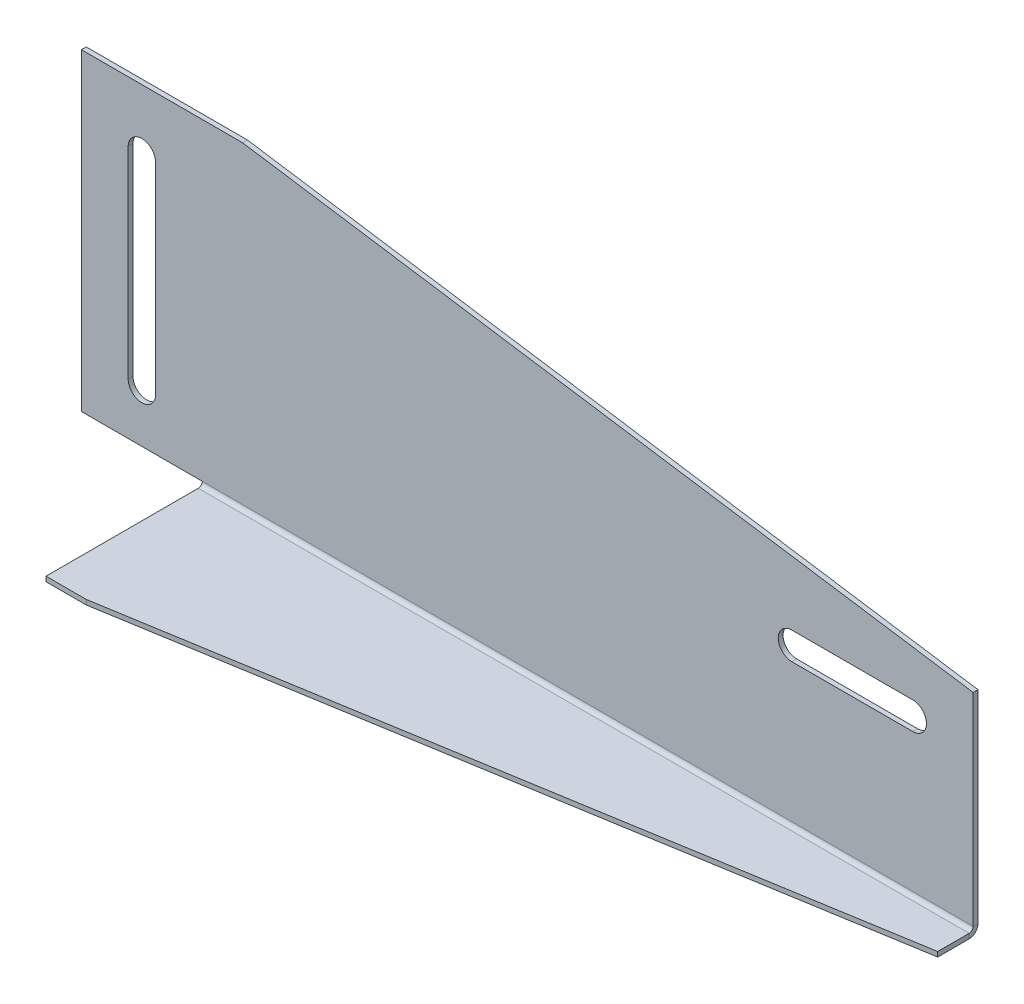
ISO-10303-21;
HEADER;
FILE_DESCRIPTION(('STEP AP214'),'2;1');
FILE_NAME('part.step','',(''),(''),'','','');
FILE_SCHEMA(('AUTOMOTIVE_DESIGN { 1 0 10303 214 1 1 1 1 }'));
ENDSEC;
DATA;
#1=APPLICATION_CONTEXT('core data for automotive mechanical design processes');
#2=APPLICATION_PROTOCOL_DEFINITION('international standard','automotive_design',2000,#1);
#3=PRODUCT_CONTEXT('',#1,'mechanical');
#4=PRODUCT('Part','Part','',(#3));
#5=PRODUCT_RELATED_PRODUCT_CATEGORY('part','',(#4));
#6=PRODUCT_DEFINITION_FORMATION('','',#4);
#7=PRODUCT_DEFINITION_CONTEXT('part definition',#1,'design');
#8=PRODUCT_DEFINITION('design','',#6,#7);
#9=PRODUCT_DEFINITION_SHAPE('','',#8);
#10=(LENGTH_UNIT() NAMED_UNIT(*) SI_UNIT(.MILLI.,.METRE.));
#11=(NAMED_UNIT(*) PLANE_ANGLE_UNIT() SI_UNIT($,.RADIAN.));
#12=(NAMED_UNIT(*) SI_UNIT($,.STERADIAN.) SOLID_ANGLE_UNIT());
#13=UNCERTAINTY_MEASURE_WITH_UNIT(LENGTH_MEASURE(1.E-05),#10,'distance_accuracy_value','');
#14=(GEOMETRIC_REPRESENTATION_CONTEXT(3) GLOBAL_UNCERTAINTY_ASSIGNED_CONTEXT((#13)) GLOBAL_UNIT_ASSIGNED_CONTEXT((#10,
#11,#12)) REPRESENTATION_CONTEXT('',''));
#15=CARTESIAN_POINT('',(0.,0.,0.));
#16=DIRECTION('',(0.,0.,1.));
#17=DIRECTION('',(1.,0.,0.));
#18=AXIS2_PLACEMENT_3D('',#15,#16,#17);
#19=CARTESIAN_POINT('',(225.,-38.8,0.));
#20=DIRECTION('',(0.,-1.,0.));
#21=DIRECTION('',(0.,0.,-1.));
#22=AXIS2_PLACEMENT_3D('',#19,#20,#21);
#23=PLANE('',#22);
#24=DIRECTION('',(0.,0.,-1.));
#25=VECTOR('',#24,1.);
#26=CARTESIAN_POINT('',(30.,-38.8,0.));
#27=LINE('',#26,#25);
#28=CARTESIAN_POINT('',(30.,-38.8,40.));
#29=VERTEX_POINT('',#28);
#30=CARTESIAN_POINT('',(30.,-38.8,2.19999999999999));
#31=VERTEX_POINT('',#30);
#32=EDGE_CURVE('E242',#29,#31,#27,.T.);
#33=ORIENTED_EDGE('',*,*,#32,.F.);
#34=DIRECTION('',(-1.,0.,0.));
#35=VECTOR('',#34,1.);
#36=CARTESIAN_POINT('',(225.,-38.8,40.));
#37=LINE('',#36,#35);
#38=CARTESIAN_POINT('',(40.,-38.8,40.));
#39=VERTEX_POINT('',#38);
#40=EDGE_CURVE('E52',#39,#29,#37,.T.);
#41=ORIENTED_EDGE('',*,*,#40,.F.);
#42=DIRECTION('',(-0.986598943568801,0.,0.163164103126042));
#43=VECTOR('',#42,1.);
#44=CARTESIAN_POINT('',(40.,-38.8,40.));
#45=LINE('',#44,#43);
#46=CARTESIAN_POINT('',(221.4,-38.8,9.99999999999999));
#47=VERTEX_POINT('',#46);
#48=EDGE_CURVE('E240',#47,#39,#45,.T.);
#49=ORIENTED_EDGE('',*,*,#48,.F.);
#50=DIRECTION('',(0.,0.,-1.));
#51=VECTOR('',#50,1.);
#52=CARTESIAN_POINT('',(221.4,-38.8,0.));
#53=LINE('',#52,#51);
#54=CARTESIAN_POINT('',(221.4,-38.8,2.19999999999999));
#55=VERTEX_POINT('',#54);
#56=EDGE_CURVE('E284',#47,#55,#53,.T.);
#57=ORIENTED_EDGE('',*,*,#56,.T.);
#58=DIRECTION('',(-1.,0.,0.));
#59=VECTOR('',#58,1.);
#60=CARTESIAN_POINT('',(225.,-38.8,2.19999999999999));
#61=LINE('',#60,#59);
#62=EDGE_CURVE('E212',#55,#31,#61,.T.);
#63=ORIENTED_EDGE('',*,*,#62,.T.);
#64=EDGE_LOOP('',(#33,#41,#49,#57,#63));
#65=FACE_BOUND('',#64,.T.);
#66=ADVANCED_FACE('F44',(#65),#23,.F.);
#67=CARTESIAN_POINT('',(225.,-40.,40.));
#68=DIRECTION('',(0.,0.,1.));
#69=DIRECTION('',(1.,0.,0.));
#70=AXIS2_PLACEMENT_3D('',#67,#68,#69);
#71=PLANE('',#70);
#72=ORIENTED_EDGE('',*,*,#40,.T.);
#73=DIRECTION('',(0.,-1.,0.));
#74=VECTOR('',#73,1.);
#75=CARTESIAN_POINT('',(30.,-40.,40.));
#76=LINE('',#75,#74);
#77=CARTESIAN_POINT('',(30.,-40.,40.));
#78=VERTEX_POINT('',#77);
#79=EDGE_CURVE('E235',#78,#29,#76,.F.);
#80=ORIENTED_EDGE('',*,*,#79,.F.);
#81=DIRECTION('',(-1.,0.,0.));
#82=VECTOR('',#81,1.);
#83=CARTESIAN_POINT('',(225.,-40.,40.));
#84=LINE('',#83,#82);
#85=CARTESIAN_POINT('',(40.,-40.,40.));
#86=VERTEX_POINT('',#85);
#87=EDGE_CURVE('E226',#86,#78,#84,.T.);
#88=ORIENTED_EDGE('',*,*,#87,.F.);
#89=DIRECTION('',(0.,1.,0.));
#90=VECTOR('',#89,1.);
#91=CARTESIAN_POINT('',(40.,-38.8,40.));
#92=LINE('',#91,#90);
#93=EDGE_CURVE('E236',#39,#86,#92,.F.);
#94=ORIENTED_EDGE('',*,*,#93,.F.);
#95=EDGE_LOOP('',(#72,#80,#88,#94));
#96=FACE_BOUND('',#95,.T.);
#97=ADVANCED_FACE('F233',(#96),#71,.T.);
#98=CARTESIAN_POINT('',(225.,-40.,0.));
#99=DIRECTION('',(0.,-1.,0.));
#100=DIRECTION('',(0.,0.,-1.));
#101=AXIS2_PLACEMENT_3D('',#98,#99,#100);
#102=PLANE('',#101);
#103=ORIENTED_EDGE('',*,*,#87,.T.);
#104=DIRECTION('',(0.,0.,-1.));
#105=VECTOR('',#104,1.);
#106=CARTESIAN_POINT('',(30.,-40.,1.19999999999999));
#107=LINE('',#106,#105);
#108=CARTESIAN_POINT('',(30.,-40.,2.19999999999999));
#109=VERTEX_POINT('',#108);
#110=EDGE_CURVE('E248',#78,#109,#107,.T.);
#111=ORIENTED_EDGE('',*,*,#110,.T.);
#112=DIRECTION('',(-1.,0.,0.));
#113=VECTOR('',#112,1.);
#114=CARTESIAN_POINT('',(225.,-40.,2.19999999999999));
#115=LINE('',#114,#113);
#116=CARTESIAN_POINT('',(221.4,-40.,2.19999999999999));
#117=VERTEX_POINT('',#116);
#118=EDGE_CURVE('E223',#117,#109,#115,.T.);
#119=ORIENTED_EDGE('',*,*,#118,.F.);
#120=DIRECTION('',(0.,0.,-1.));
#121=VECTOR('',#120,1.);
#122=CARTESIAN_POINT('',(221.4,-40.,40.001));
#123=LINE('',#122,#121);
#124=CARTESIAN_POINT('',(221.4,-40.,9.99999999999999));
#125=VERTEX_POINT('',#124);
#126=EDGE_CURVE('E281',#125,#117,#123,.T.);
#127=ORIENTED_EDGE('',*,*,#126,.F.);
#128=DIRECTION('',(-0.986598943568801,0.,0.163164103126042));
#129=VECTOR('',#128,1.);
#130=CARTESIAN_POINT('',(40.,-40.,40.));
#131=LINE('',#130,#129);
#132=EDGE_CURVE('E59',#125,#86,#131,.T.);
#133=ORIENTED_EDGE('',*,*,#132,.T.);
#134=EDGE_LOOP('',(#103,#111,#119,#127,#133));
#135=FACE_BOUND('',#134,.T.);
#136=ADVANCED_FACE('F380',(#135),#102,.T.);
#137=CARTESIAN_POINT('',(225.,-37.8,2.19999999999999));
#138=DIRECTION('',(-1.,0.,0.));
#139=DIRECTION('',(0.,0.,1.));
#140=AXIS2_PLACEMENT_3D('',#137,#138,#139);
#141=CYLINDRICAL_SURFACE('',#140,2.2);
#142=ORIENTED_EDGE('',*,*,#118,.T.);
#143=CARTESIAN_POINT('',(30.,-37.8,2.19999999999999));
#144=DIRECTION('',(-1.,0.,0.));
#145=DIRECTION('',(0.,0.,1.));
#146=AXIS2_PLACEMENT_3D('',#143,#144,#145);
#147=CIRCLE('',#146,2.2);
#148=CARTESIAN_POINT('',(30.,-37.8,0.));
#149=VERTEX_POINT('',#148);
#150=EDGE_CURVE('E198',#109,#149,#147,.F.);
#151=ORIENTED_EDGE('',*,*,#150,.T.);
#152=DIRECTION('',(-1.,0.,0.));
#153=VECTOR('',#152,1.);
#154=CARTESIAN_POINT('',(225.,-37.8,0.));
#155=LINE('',#154,#153);
#156=CARTESIAN_POINT('',(221.4,-37.8,0.));
#157=VERTEX_POINT('',#156);
#158=EDGE_CURVE('E196',#157,#149,#155,.T.);
#159=ORIENTED_EDGE('',*,*,#158,.F.);
#160=CARTESIAN_POINT('',(221.4,-37.8,2.19999999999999));
#161=DIRECTION('',(1.,0.,0.));
#162=DIRECTION('',(0.,0.,-1.));
#163=AXIS2_PLACEMENT_3D('',#160,#161,#162);
#164=CIRCLE('',#163,2.2);
#165=EDGE_CURVE('E261',#117,#157,#164,.T.);
#166=ORIENTED_EDGE('',*,*,#165,.F.);
#167=EDGE_LOOP('',(#142,#151,#159,#166));
#168=FACE_BOUND('',#167,.T.);
#169=ADVANCED_FACE('F385',(#168),#141,.T.);
#170=CARTESIAN_POINT('',(225.,-37.8,2.19999999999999));
#171=DIRECTION('',(-1.,0.,0.));
#172=DIRECTION('',(0.,0.,1.));
#173=AXIS2_PLACEMENT_3D('',#170,#171,#172);
#174=CYLINDRICAL_SURFACE('',#173,1.);
#175=CARTESIAN_POINT('',(30.,-37.8,2.19999999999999));
#176=DIRECTION('',(1.,0.,0.));
#177=DIRECTION('',(0.,0.,-1.));
#178=AXIS2_PLACEMENT_3D('',#175,#176,#177);
#179=CIRCLE('',#178,1.);
#180=CARTESIAN_POINT('',(30.,-37.8,1.19999999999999));
#181=VERTEX_POINT('',#180);
#182=EDGE_CURVE('E476',#31,#181,#179,.T.);
#183=ORIENTED_EDGE('',*,*,#182,.F.);
#184=ORIENTED_EDGE('',*,*,#62,.F.);
#185=CARTESIAN_POINT('',(221.4,-37.8,2.19999999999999));
#186=DIRECTION('',(-1.,0.,0.));
#187=DIRECTION('',(0.,0.,1.));
#188=AXIS2_PLACEMENT_3D('',#185,#186,#187);
#189=CIRCLE('',#188,1.);
#190=CARTESIAN_POINT('',(221.4,-37.8,1.19999999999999));
#191=VERTEX_POINT('',#190);
#192=EDGE_CURVE('E263',#55,#191,#189,.F.);
#193=ORIENTED_EDGE('',*,*,#192,.T.);
#194=DIRECTION('',(-1.,0.,0.));
#195=VECTOR('',#194,1.);
#196=CARTESIAN_POINT('',(225.,-37.8,1.19999999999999));
#197=LINE('',#196,#195);
#198=EDGE_CURVE('E215',#191,#181,#197,.T.);
#199=ORIENTED_EDGE('',*,*,#198,.T.);
#200=EDGE_LOOP('',(#183,#184,#193,#199));
#201=FACE_BOUND('',#200,.T.);
#202=ADVANCED_FACE('F389',(#201),#174,.F.);
#203=CARTESIAN_POINT('',(221.4,-40.,40.001));
#204=DIRECTION('',(-1.,0.,0.));
#205=DIRECTION('',(0.,0.,-1.));
#206=AXIS2_PLACEMENT_3D('',#203,#204,#205);
#207=PLANE('',#206);
#208=ORIENTED_EDGE('',*,*,#56,.F.);
#209=DIRECTION('',(0.,1.,0.));
#210=VECTOR('',#209,1.);
#211=CARTESIAN_POINT('',(221.4,-38.8,9.99999999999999));
#212=LINE('',#211,#210);
#213=EDGE_CURVE('E259',#47,#125,#212,.F.);
#214=ORIENTED_EDGE('',*,*,#213,.T.);
#215=ORIENTED_EDGE('',*,*,#126,.T.);
#216=DIRECTION('',(0.,-1.,0.));
#217=VECTOR('',#216,1.);
#218=CARTESIAN_POINT('',(221.4,-40.,2.19999999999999));
#219=LINE('',#218,#217);
#220=EDGE_CURVE('E286',#117,#55,#219,.F.);
#221=ORIENTED_EDGE('',*,*,#220,.T.);
#222=EDGE_LOOP('',(#208,#214,#215,#221));
#223=FACE_BOUND('',#222,.T.);
#224=ADVANCED_FACE('F393',(#223),#207,.F.);
#225=CARTESIAN_POINT('',(225.,40.,0.));
#226=DIRECTION('',(0.,0.,-1.));
#227=DIRECTION('',(-1.,0.,0.));
#228=AXIS2_PLACEMENT_3D('',#225,#226,#227);
#229=PLANE('',#228);
#230=CARTESIAN_POINT('',(176.4,0.,0.));
#231=DIRECTION('',(0.,0.,-1.));
#232=DIRECTION('',(-1.,0.,0.));
#233=AXIS2_PLACEMENT_3D('',#230,#231,#232);
#234=CIRCLE('',#233,3.4);
#235=CARTESIAN_POINT('',(176.4,-3.4,0.));
#236=VERTEX_POINT('',#235);
#237=CARTESIAN_POINT('',(176.4,3.4,0.));
#238=VERTEX_POINT('',#237);
#239=EDGE_CURVE('E293',#236,#238,#234,.T.);
#240=ORIENTED_EDGE('',*,*,#239,.F.);
#241=DIRECTION('',(-1.,0.,0.));
#242=VECTOR('',#241,1.);
#243=CARTESIAN_POINT('',(225.,-3.4,0.));
#244=LINE('',#243,#242);
#245=CARTESIAN_POINT('',(206.4,-3.4,0.));
#246=VERTEX_POINT('',#245);
#247=EDGE_CURVE('E298',#246,#236,#244,.T.);
#248=ORIENTED_EDGE('',*,*,#247,.F.);
#249=CARTESIAN_POINT('',(206.4,0.,0.));
#250=DIRECTION('',(0.,0.,-1.));
#251=DIRECTION('',(-1.,0.,0.));
#252=AXIS2_PLACEMENT_3D('',#249,#250,#251);
#253=CIRCLE('',#252,3.4);
#254=CARTESIAN_POINT('',(206.4,3.4,0.));
#255=VERTEX_POINT('',#254);
#256=EDGE_CURVE('E295',#255,#246,#253,.T.);
#257=ORIENTED_EDGE('',*,*,#256,.F.);
#258=DIRECTION('',(-1.,0.,0.));
#259=VECTOR('',#258,1.);
#260=CARTESIAN_POINT('',(225.,3.4,0.));
#261=LINE('',#260,#259);
#262=EDGE_CURVE('E291',#238,#255,#261,.F.);
#263=ORIENTED_EDGE('',*,*,#262,.F.);
#264=EDGE_LOOP('',(#240,#248,#257,#263));
#265=FACE_BOUND('',#264,.T.);
#266=CARTESIAN_POINT('',(15.,25.,0.));
#267=DIRECTION('',(0.,0.,-1.));
#268=DIRECTION('',(-1.,0.,0.));
#269=AXIS2_PLACEMENT_3D('',#266,#267,#268);
#270=CIRCLE('',#269,3.40000000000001);
#271=CARTESIAN_POINT('',(11.6,25.,0.));
#272=VERTEX_POINT('',#271);
#273=CARTESIAN_POINT('',(18.4,25.,0.));
#274=VERTEX_POINT('',#273);
#275=EDGE_CURVE('E325',#272,#274,#270,.T.);
#276=ORIENTED_EDGE('',*,*,#275,.F.);
#277=DIRECTION('',(0.,1.,0.));
#278=VECTOR('',#277,1.);
#279=CARTESIAN_POINT('',(11.6,40.,0.));
#280=LINE('',#279,#278);
#281=CARTESIAN_POINT('',(11.6,-25.,0.));
#282=VERTEX_POINT('',#281);
#283=EDGE_CURVE('E329',#282,#272,#280,.T.);
#284=ORIENTED_EDGE('',*,*,#283,.F.);
#285=CARTESIAN_POINT('',(15.,-25.,0.));
#286=DIRECTION('',(0.,0.,-1.));
#287=DIRECTION('',(-1.,0.,0.));
#288=AXIS2_PLACEMENT_3D('',#285,#286,#287);
#289=CIRCLE('',#288,3.40000000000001);
#290=CARTESIAN_POINT('',(18.4,-25.,0.));
#291=VERTEX_POINT('',#290);
#292=EDGE_CURVE('E327',#291,#282,#289,.T.);
#293=ORIENTED_EDGE('',*,*,#292,.F.);
#294=DIRECTION('',(0.,1.,0.));
#295=VECTOR('',#294,1.);
#296=CARTESIAN_POINT('',(18.4,40.,0.));
#297=LINE('',#296,#295);
#298=EDGE_CURVE('E323',#274,#291,#297,.F.);
#299=ORIENTED_EDGE('',*,*,#298,.F.);
#300=EDGE_LOOP('',(#276,#284,#293,#299));
#301=FACE_BOUND('',#300,.T.);
#302=DIRECTION('',(-0.988703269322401,0.149886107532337,0.));
#303=VECTOR('',#302,1.);
#304=CARTESIAN_POINT('',(40.,40.,0.));
#305=LINE('',#304,#303);
#306=CARTESIAN_POINT('',(221.4,12.5,0.));
#307=VERTEX_POINT('',#306);
#308=CARTESIAN_POINT('',(40.,40.,0.));
#309=VERTEX_POINT('',#308);
#310=EDGE_CURVE('E271',#307,#309,#305,.T.);
#311=ORIENTED_EDGE('',*,*,#310,.F.);
#312=DIRECTION('',(0.,1.,0.));
#313=VECTOR('',#312,1.);
#314=CARTESIAN_POINT('',(221.4,40.,0.));
#315=LINE('',#314,#313);
#316=EDGE_CURVE('E268',#157,#307,#315,.T.);
#317=ORIENTED_EDGE('',*,*,#316,.F.);
#318=ORIENTED_EDGE('',*,*,#158,.T.);
#319=DIRECTION('',(-1.,0.,0.));
#320=VECTOR('',#319,1.);
#321=CARTESIAN_POINT('',(225.,-37.8,0.));
#322=LINE('',#321,#320);
#323=CARTESIAN_POINT('',(0.,-37.8,0.));
#324=VERTEX_POINT('',#323);
#325=EDGE_CURVE('E178',#324,#149,#322,.F.);
#326=ORIENTED_EDGE('',*,*,#325,.F.);
#327=DIRECTION('',(0.,-1.,0.));
#328=VECTOR('',#327,1.);
#329=CARTESIAN_POINT('',(0.,40.,0.));
#330=LINE('',#329,#328);
#331=CARTESIAN_POINT('',(0.,40.,0.));
#332=VERTEX_POINT('',#331);
#333=EDGE_CURVE('E192',#332,#324,#330,.T.);
#334=ORIENTED_EDGE('',*,*,#333,.F.);
#335=DIRECTION('',(-1.,0.,0.));
#336=VECTOR('',#335,1.);
#337=CARTESIAN_POINT('',(225.,40.,0.));
#338=LINE('',#337,#336);
#339=EDGE_CURVE('E220',#309,#332,#338,.T.);
#340=ORIENTED_EDGE('',*,*,#339,.F.);
#341=EDGE_LOOP('',(#311,#317,#318,#326,#334,#340));
#342=FACE_BOUND('',#341,.T.);
#343=ADVANCED_FACE('F190',(#265,#301,#342),#229,.T.);
#344=CARTESIAN_POINT('',(225.,40.,1.19999999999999));
#345=DIRECTION('',(0.,0.,-1.));
#346=DIRECTION('',(-1.,0.,0.));
#347=AXIS2_PLACEMENT_3D('',#344,#345,#346);
#348=PLANE('',#347);
#349=DIRECTION('',(-1.,0.,0.));
#350=VECTOR('',#349,1.);
#351=CARTESIAN_POINT('',(176.4,-3.4,1.19999999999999));
#352=LINE('',#351,#350);
#353=CARTESIAN_POINT('',(206.4,-3.4,1.19999999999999));
#354=VERTEX_POINT('',#353);
#355=CARTESIAN_POINT('',(176.4,-3.4,1.19999999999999));
#356=VERTEX_POINT('',#355);
#357=EDGE_CURVE('E307',#354,#356,#352,.T.);
#358=ORIENTED_EDGE('',*,*,#357,.T.);
#359=CARTESIAN_POINT('',(176.4,0.,1.19999999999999));
#360=DIRECTION('',(0.,0.,-1.));
#361=DIRECTION('',(-1.,0.,0.));
#362=AXIS2_PLACEMENT_3D('',#359,#360,#361);
#363=CIRCLE('',#362,3.4);
#364=CARTESIAN_POINT('',(176.4,3.4,1.19999999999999));
#365=VERTEX_POINT('',#364);
#366=EDGE_CURVE('E304',#356,#365,#363,.T.);
#367=ORIENTED_EDGE('',*,*,#366,.T.);
#368=DIRECTION('',(1.,0.,0.));
#369=VECTOR('',#368,1.);
#370=CARTESIAN_POINT('',(176.4,3.4,1.19999999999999));
#371=LINE('',#370,#369);
#372=CARTESIAN_POINT('',(206.4,3.4,1.19999999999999));
#373=VERTEX_POINT('',#372);
#374=EDGE_CURVE('E290',#365,#373,#371,.T.);
#375=ORIENTED_EDGE('',*,*,#374,.T.);
#376=CARTESIAN_POINT('',(206.4,0.,1.19999999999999));
#377=DIRECTION('',(0.,0.,-1.));
#378=DIRECTION('',(-1.,0.,0.));
#379=AXIS2_PLACEMENT_3D('',#376,#377,#378);
#380=CIRCLE('',#379,3.4);
#381=EDGE_CURVE('E294',#373,#354,#380,.T.);
#382=ORIENTED_EDGE('',*,*,#381,.T.);
#383=EDGE_LOOP('',(#358,#367,#375,#382));
#384=FACE_BOUND('',#383,.T.);
#385=DIRECTION('',(0.,1.,0.));
#386=VECTOR('',#385,1.);
#387=CARTESIAN_POINT('',(11.6,25.,1.19999999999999));
#388=LINE('',#387,#386);
#389=CARTESIAN_POINT('',(11.6,-25.,1.19999999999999));
#390=VERTEX_POINT('',#389);
#391=CARTESIAN_POINT('',(11.6,25.,1.19999999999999));
#392=VERTEX_POINT('',#391);
#393=EDGE_CURVE('E338',#390,#392,#388,.T.);
#394=ORIENTED_EDGE('',*,*,#393,.T.);
#395=CARTESIAN_POINT('',(15.,25.,1.19999999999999));
#396=DIRECTION('',(0.,0.,-1.));
#397=DIRECTION('',(-1.,0.,0.));
#398=AXIS2_PLACEMENT_3D('',#395,#396,#397);
#399=CIRCLE('',#398,3.40000000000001);
#400=CARTESIAN_POINT('',(18.4,25.,1.19999999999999));
#401=VERTEX_POINT('',#400);
#402=EDGE_CURVE('E335',#392,#401,#399,.T.);
#403=ORIENTED_EDGE('',*,*,#402,.T.);
#404=DIRECTION('',(0.,-1.,0.));
#405=VECTOR('',#404,1.);
#406=CARTESIAN_POINT('',(18.4,25.,1.19999999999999));
#407=LINE('',#406,#405);
#408=CARTESIAN_POINT('',(18.4,-25.,1.19999999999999));
#409=VERTEX_POINT('',#408);
#410=EDGE_CURVE('E320',#401,#409,#407,.T.);
#411=ORIENTED_EDGE('',*,*,#410,.T.);
#412=CARTESIAN_POINT('',(15.,-25.,1.19999999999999));
#413=DIRECTION('',(0.,0.,-1.));
#414=DIRECTION('',(-1.,0.,0.));
#415=AXIS2_PLACEMENT_3D('',#412,#413,#414);
#416=CIRCLE('',#415,3.40000000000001);
#417=EDGE_CURVE('E326',#409,#390,#416,.T.);
#418=ORIENTED_EDGE('',*,*,#417,.T.);
#419=EDGE_LOOP('',(#394,#403,#411,#418));
#420=FACE_BOUND('',#419,.T.);
#421=DIRECTION('',(0.,1.,0.));
#422=VECTOR('',#421,1.);
#423=CARTESIAN_POINT('',(221.4,12.5,1.19999999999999));
#424=LINE('',#423,#422);
#425=CARTESIAN_POINT('',(221.4,12.5,1.19999999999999));
#426=VERTEX_POINT('',#425);
#427=EDGE_CURVE('E67',#191,#426,#424,.T.);
#428=ORIENTED_EDGE('',*,*,#427,.T.);
#429=DIRECTION('',(-0.988703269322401,0.149886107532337,0.));
#430=VECTOR('',#429,1.);
#431=CARTESIAN_POINT('',(40.,40.,1.19999999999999));
#432=LINE('',#431,#430);
#433=CARTESIAN_POINT('',(40.,40.,1.19999999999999));
#434=VERTEX_POINT('',#433);
#435=EDGE_CURVE('E266',#426,#434,#432,.T.);
#436=ORIENTED_EDGE('',*,*,#435,.T.);
#437=DIRECTION('',(-1.,0.,0.));
#438=VECTOR('',#437,1.);
#439=CARTESIAN_POINT('',(225.,40.,1.19999999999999));
#440=LINE('',#439,#438);
#441=CARTESIAN_POINT('',(0.,40.,1.19999999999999));
#442=VERTEX_POINT('',#441);
#443=EDGE_CURVE('E218',#434,#442,#440,.T.);
#444=ORIENTED_EDGE('',*,*,#443,.T.);
#445=DIRECTION('',(0.,1.,0.));
#446=VECTOR('',#445,1.);
#447=CARTESIAN_POINT('',(0.,40.,1.19999999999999));
#448=LINE('',#447,#446);
#449=CARTESIAN_POINT('',(0.,-37.8,1.19999999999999));
#450=VERTEX_POINT('',#449);
#451=EDGE_CURVE('E204',#442,#450,#448,.F.);
#452=ORIENTED_EDGE('',*,*,#451,.T.);
#453=DIRECTION('',(-1.,0.,0.));
#454=VECTOR('',#453,1.);
#455=CARTESIAN_POINT('',(225.,-37.8,1.19999999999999));
#456=LINE('',#455,#454);
#457=EDGE_CURVE('E181',#450,#181,#456,.F.);
#458=ORIENTED_EDGE('',*,*,#457,.T.);
#459=ORIENTED_EDGE('',*,*,#198,.F.);
#460=EDGE_LOOP('',(#428,#436,#444,#452,#458,#459));
#461=FACE_BOUND('',#460,.T.);
#462=ADVANCED_FACE('F365',(#384,#420,#461),#348,.F.);
#463=CARTESIAN_POINT('',(225.,40.,1.19999999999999));
#464=DIRECTION('',(0.,1.,0.));
#465=DIRECTION('',(0.,0.,1.));
#466=AXIS2_PLACEMENT_3D('',#463,#464,#465);
#467=PLANE('',#466);
#468=ORIENTED_EDGE('',*,*,#443,.F.);
#469=DIRECTION('',(0.,0.,1.));
#470=VECTOR('',#469,1.);
#471=CARTESIAN_POINT('',(40.,40.,1.19999999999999));
#472=LINE('',#471,#470);
#473=EDGE_CURVE('E270',#434,#309,#472,.F.);
#474=ORIENTED_EDGE('',*,*,#473,.T.);
#475=ORIENTED_EDGE('',*,*,#339,.T.);
#476=DIRECTION('',(0.,0.,-1.));
#477=VECTOR('',#476,1.);
#478=CARTESIAN_POINT('',(0.,40.,1.19999999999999));
#479=LINE('',#478,#477);
#480=EDGE_CURVE('E201',#442,#332,#479,.T.);
#481=ORIENTED_EDGE('',*,*,#480,.F.);
#482=EDGE_LOOP('',(#468,#474,#475,#481));
#483=FACE_BOUND('',#482,.T.);
#484=ADVANCED_FACE('F395',(#483),#467,.T.);
#485=CARTESIAN_POINT('',(0.,-38.8,2.19999999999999));
#486=DIRECTION('',(-1.,0.,0.));
#487=DIRECTION('',(0.,0.,1.));
#488=AXIS2_PLACEMENT_3D('',#485,#486,#487);
#489=PLANE('',#488);
#490=ORIENTED_EDGE('',*,*,#333,.T.);
#491=DIRECTION('',(0.,0.,1.));
#492=VECTOR('',#491,1.);
#493=CARTESIAN_POINT('',(0.,-37.8,0.));
#494=LINE('',#493,#492);
#495=EDGE_CURVE('E13',#324,#450,#494,.T.);
#496=ORIENTED_EDGE('',*,*,#495,.T.);
#497=ORIENTED_EDGE('',*,*,#451,.F.);
#498=ORIENTED_EDGE('',*,*,#480,.T.);
#499=EDGE_LOOP('',(#490,#496,#497,#498));
#500=FACE_BOUND('',#499,.T.);
#501=ADVANCED_FACE('F46',(#500),#489,.T.);
#502=CARTESIAN_POINT('',(11.6,25.,1.19999999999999));
#503=DIRECTION('',(-1.,0.,0.));
#504=DIRECTION('',(0.,1.,0.));
#505=AXIS2_PLACEMENT_3D('',#502,#503,#504);
#506=PLANE('',#505);
#507=DIRECTION('',(0.,0.,1.));
#508=VECTOR('',#507,1.);
#509=CARTESIAN_POINT('',(11.6,25.,1.19999999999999));
#510=LINE('',#509,#508);
#511=EDGE_CURVE('E202',#392,#272,#510,.F.);
#512=ORIENTED_EDGE('',*,*,#511,.F.);
#513=ORIENTED_EDGE('',*,*,#393,.F.);
#514=DIRECTION('',(0.,0.,1.));
#515=VECTOR('',#514,1.);
#516=CARTESIAN_POINT('',(11.6,-25.,1.19999999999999));
#517=LINE('',#516,#515);
#518=EDGE_CURVE('E206',#390,#282,#517,.F.);
#519=ORIENTED_EDGE('',*,*,#518,.T.);
#520=ORIENTED_EDGE('',*,*,#283,.T.);
#521=EDGE_LOOP('',(#512,#513,#519,#520));
#522=FACE_BOUND('',#521,.T.);
#523=ADVANCED_FACE('F351',(#522),#506,.F.);
#524=CARTESIAN_POINT('',(15.,-25.,1.19999999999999));
#525=DIRECTION('',(0.,0.,-1.));
#526=DIRECTION('',(-1.,0.,0.));
#527=AXIS2_PLACEMENT_3D('',#524,#525,#526);
#528=CYLINDRICAL_SURFACE('',#527,3.40000000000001);
#529=ORIENTED_EDGE('',*,*,#518,.F.);
#530=ORIENTED_EDGE('',*,*,#417,.F.);
#531=DIRECTION('',(0.,0.,1.));
#532=VECTOR('',#531,1.);
#533=CARTESIAN_POINT('',(18.4,-25.,1.19999999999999));
#534=LINE('',#533,#532);
#535=EDGE_CURVE('E343',#409,#291,#534,.F.);
#536=ORIENTED_EDGE('',*,*,#535,.T.);
#537=ORIENTED_EDGE('',*,*,#292,.T.);
#538=EDGE_LOOP('',(#529,#530,#536,#537));
#539=FACE_BOUND('',#538,.T.);
#540=ADVANCED_FACE('F367',(#539),#528,.F.);
#541=CARTESIAN_POINT('',(18.4,25.,1.19999999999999));
#542=DIRECTION('',(1.,0.,0.));
#543=DIRECTION('',(0.,-1.,0.));
#544=AXIS2_PLACEMENT_3D('',#541,#542,#543);
#545=PLANE('',#544);
#546=ORIENTED_EDGE('',*,*,#535,.F.);
#547=ORIENTED_EDGE('',*,*,#410,.F.);
#548=DIRECTION('',(0.,0.,1.));
#549=VECTOR('',#548,1.);
#550=CARTESIAN_POINT('',(18.4,25.,1.19999999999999));
#551=LINE('',#550,#549);
#552=EDGE_CURVE('E209',#401,#274,#551,.F.);
#553=ORIENTED_EDGE('',*,*,#552,.T.);
#554=ORIENTED_EDGE('',*,*,#298,.T.);
#555=EDGE_LOOP('',(#546,#547,#553,#554));
#556=FACE_BOUND('',#555,.T.);
#557=ADVANCED_FACE('F363',(#556),#545,.F.);
#558=CARTESIAN_POINT('',(15.,25.,1.19999999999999));
#559=DIRECTION('',(0.,0.,-1.));
#560=DIRECTION('',(-1.,0.,0.));
#561=AXIS2_PLACEMENT_3D('',#558,#559,#560);
#562=CYLINDRICAL_SURFACE('',#561,3.40000000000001);
#563=ORIENTED_EDGE('',*,*,#402,.F.);
#564=ORIENTED_EDGE('',*,*,#511,.T.);
#565=ORIENTED_EDGE('',*,*,#275,.T.);
#566=ORIENTED_EDGE('',*,*,#552,.F.);
#567=EDGE_LOOP('',(#563,#564,#565,#566));
#568=FACE_BOUND('',#567,.T.);
#569=ADVANCED_FACE('F359',(#568),#562,.F.);
#570=CARTESIAN_POINT('',(176.4,-3.4,1.19999999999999));
#571=DIRECTION('',(0.,-1.,0.));
#572=DIRECTION('',(-1.,0.,0.));
#573=AXIS2_PLACEMENT_3D('',#570,#571,#572);
#574=PLANE('',#573);
#575=DIRECTION('',(0.,0.,1.));
#576=VECTOR('',#575,1.);
#577=CARTESIAN_POINT('',(176.4,-3.4,1.19999999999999));
#578=LINE('',#577,#576);
#579=EDGE_CURVE('E318',#356,#236,#578,.F.);
#580=ORIENTED_EDGE('',*,*,#579,.F.);
#581=ORIENTED_EDGE('',*,*,#357,.F.);
#582=DIRECTION('',(0.,0.,1.));
#583=VECTOR('',#582,1.);
#584=CARTESIAN_POINT('',(206.4,-3.4,1.19999999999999));
#585=LINE('',#584,#583);
#586=EDGE_CURVE('E315',#354,#246,#585,.F.);
#587=ORIENTED_EDGE('',*,*,#586,.T.);
#588=ORIENTED_EDGE('',*,*,#247,.T.);
#589=EDGE_LOOP('',(#580,#581,#587,#588));
#590=FACE_BOUND('',#589,.T.);
#591=ADVANCED_FACE('F406',(#590),#574,.F.);
#592=CARTESIAN_POINT('',(206.4,0.,1.19999999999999));
#593=DIRECTION('',(0.,0.,-1.));
#594=DIRECTION('',(-1.,0.,0.));
#595=AXIS2_PLACEMENT_3D('',#592,#593,#594);
#596=CYLINDRICAL_SURFACE('',#595,3.4);
#597=ORIENTED_EDGE('',*,*,#586,.F.);
#598=ORIENTED_EDGE('',*,*,#381,.F.);
#599=DIRECTION('',(0.,0.,1.));
#600=VECTOR('',#599,1.);
#601=CARTESIAN_POINT('',(206.4,3.4,1.19999999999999));
#602=LINE('',#601,#600);
#603=EDGE_CURVE('E312',#373,#255,#602,.F.);
#604=ORIENTED_EDGE('',*,*,#603,.T.);
#605=ORIENTED_EDGE('',*,*,#256,.T.);
#606=EDGE_LOOP('',(#597,#598,#604,#605));
#607=FACE_BOUND('',#606,.T.);
#608=ADVANCED_FACE('F410',(#607),#596,.F.);
#609=CARTESIAN_POINT('',(176.4,3.4,1.19999999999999));
#610=DIRECTION('',(0.,1.,0.));
#611=DIRECTION('',(1.,0.,0.));
#612=AXIS2_PLACEMENT_3D('',#609,#610,#611);
#613=PLANE('',#612);
#614=ORIENTED_EDGE('',*,*,#603,.F.);
#615=ORIENTED_EDGE('',*,*,#374,.F.);
#616=DIRECTION('',(0.,0.,1.));
#617=VECTOR('',#616,1.);
#618=CARTESIAN_POINT('',(176.4,3.4,1.19999999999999));
#619=LINE('',#618,#617);
#620=EDGE_CURVE('E297',#365,#238,#619,.F.);
#621=ORIENTED_EDGE('',*,*,#620,.T.);
#622=ORIENTED_EDGE('',*,*,#262,.T.);
#623=EDGE_LOOP('',(#614,#615,#621,#622));
#624=FACE_BOUND('',#623,.T.);
#625=ADVANCED_FACE('F416',(#624),#613,.F.);
#626=CARTESIAN_POINT('',(176.4,0.,1.19999999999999));
#627=DIRECTION('',(0.,0.,-1.));
#628=DIRECTION('',(-1.,0.,0.));
#629=AXIS2_PLACEMENT_3D('',#626,#627,#628);
#630=CYLINDRICAL_SURFACE('',#629,3.4);
#631=ORIENTED_EDGE('',*,*,#366,.F.);
#632=ORIENTED_EDGE('',*,*,#579,.T.);
#633=ORIENTED_EDGE('',*,*,#239,.T.);
#634=ORIENTED_EDGE('',*,*,#620,.F.);
#635=EDGE_LOOP('',(#631,#632,#633,#634));
#636=FACE_BOUND('',#635,.T.);
#637=ADVANCED_FACE('F422',(#636),#630,.F.);
#638=CARTESIAN_POINT('',(221.4,12.5,1.19999999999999));
#639=DIRECTION('',(-1.,0.,0.));
#640=DIRECTION('',(0.,1.,0.));
#641=AXIS2_PLACEMENT_3D('',#638,#639,#640);
#642=PLANE('',#641);
#643=DIRECTION('',(0.,0.,1.));
#644=VECTOR('',#643,1.);
#645=CARTESIAN_POINT('',(221.4,12.5,1.19999999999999));
#646=LINE('',#645,#644);
#647=EDGE_CURVE('E278',#426,#307,#646,.F.);
#648=ORIENTED_EDGE('',*,*,#647,.F.);
#649=ORIENTED_EDGE('',*,*,#427,.F.);
#650=DIRECTION('',(0.,0.,1.));
#651=VECTOR('',#650,1.);
#652=CARTESIAN_POINT('',(221.4,-37.8,1.19999999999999));
#653=LINE('',#652,#651);
#654=EDGE_CURVE('E276',#191,#157,#653,.F.);
#655=ORIENTED_EDGE('',*,*,#654,.T.);
#656=ORIENTED_EDGE('',*,*,#316,.T.);
#657=EDGE_LOOP('',(#648,#649,#655,#656));
#658=FACE_BOUND('',#657,.T.);
#659=ADVANCED_FACE('F424',(#658),#642,.F.);
#660=CARTESIAN_POINT('',(40.,40.,1.19999999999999));
#661=DIRECTION('',(-0.149886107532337,-0.988703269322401,0.));
#662=DIRECTION('',(-0.988703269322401,0.149886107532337,0.));
#663=AXIS2_PLACEMENT_3D('',#660,#661,#662);
#664=PLANE('',#663);
#665=ORIENTED_EDGE('',*,*,#435,.F.);
#666=ORIENTED_EDGE('',*,*,#647,.T.);
#667=ORIENTED_EDGE('',*,*,#310,.T.);
#668=ORIENTED_EDGE('',*,*,#473,.F.);
#669=EDGE_LOOP('',(#665,#666,#667,#668));
#670=FACE_BOUND('',#669,.T.);
#671=ADVANCED_FACE('F430',(#670),#664,.F.);
#672=CARTESIAN_POINT('',(221.4,-37.8,2.19999999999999));
#673=DIRECTION('',(-1.,0.,0.));
#674=DIRECTION('',(0.,0.,1.));
#675=AXIS2_PLACEMENT_3D('',#672,#673,#674);
#676=PLANE('',#675);
#677=ORIENTED_EDGE('',*,*,#220,.F.);
#678=ORIENTED_EDGE('',*,*,#165,.T.);
#679=ORIENTED_EDGE('',*,*,#654,.F.);
#680=ORIENTED_EDGE('',*,*,#192,.F.);
#681=EDGE_LOOP('',(#677,#678,#679,#680));
#682=FACE_BOUND('',#681,.T.);
#683=ADVANCED_FACE('F447',(#682),#676,.F.);
#684=CARTESIAN_POINT('',(40.,-38.8,40.));
#685=DIRECTION('',(0.163164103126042,0.,0.986598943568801));
#686=DIRECTION('',(-0.986598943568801,0.,0.163164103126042));
#687=AXIS2_PLACEMENT_3D('',#684,#685,#686);
#688=PLANE('',#687);
#689=ORIENTED_EDGE('',*,*,#213,.F.);
#690=ORIENTED_EDGE('',*,*,#48,.T.);
#691=ORIENTED_EDGE('',*,*,#93,.T.);
#692=ORIENTED_EDGE('',*,*,#132,.F.);
#693=EDGE_LOOP('',(#689,#690,#691,#692));
#694=FACE_BOUND('',#693,.T.);
#695=ADVANCED_FACE('F452',(#694),#688,.T.);
#696=CARTESIAN_POINT('',(30.,-40.,1.19999999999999));
#697=DIRECTION('',(-1.,0.,0.));
#698=DIRECTION('',(0.,0.,-1.));
#699=AXIS2_PLACEMENT_3D('',#696,#697,#698);
#700=PLANE('',#699);
#701=ORIENTED_EDGE('',*,*,#110,.F.);
#702=ORIENTED_EDGE('',*,*,#79,.T.);
#703=ORIENTED_EDGE('',*,*,#32,.T.);
#704=DIRECTION('',(0.,-1.,0.));
#705=VECTOR('',#704,1.);
#706=CARTESIAN_POINT('',(30.,-40.,2.19999999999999));
#707=LINE('',#706,#705);
#708=EDGE_CURVE('E247',#109,#31,#707,.F.);
#709=ORIENTED_EDGE('',*,*,#708,.F.);
#710=EDGE_LOOP('',(#701,#702,#703,#709));
#711=FACE_BOUND('',#710,.T.);
#712=ADVANCED_FACE('F456',(#711),#700,.T.);
#713=CARTESIAN_POINT('',(30.,-37.8,2.19999999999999));
#714=DIRECTION('',(-1.,0.,0.));
#715=DIRECTION('',(0.,0.,1.));
#716=AXIS2_PLACEMENT_3D('',#713,#714,#715);
#717=PLANE('',#716);
#718=ORIENTED_EDGE('',*,*,#150,.F.);
#719=ORIENTED_EDGE('',*,*,#708,.T.);
#720=ORIENTED_EDGE('',*,*,#182,.T.);
#721=DIRECTION('',(0.,0.,1.));
#722=VECTOR('',#721,1.);
#723=CARTESIAN_POINT('',(30.,-37.8,1.19999999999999));
#724=LINE('',#723,#722);
#725=EDGE_CURVE('E197',#181,#149,#724,.F.);
#726=ORIENTED_EDGE('',*,*,#725,.T.);
#727=EDGE_LOOP('',(#718,#719,#720,#726));
#728=FACE_BOUND('',#727,.T.);
#729=ADVANCED_FACE('F459',(#728),#717,.T.);
#730=CARTESIAN_POINT('',(15.,-37.8,1.19999999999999));
#731=DIRECTION('',(0.,-1.,0.));
#732=DIRECTION('',(-1.,0.,0.));
#733=AXIS2_PLACEMENT_3D('',#730,#731,#732);
#734=PLANE('',#733);
#735=ORIENTED_EDGE('',*,*,#457,.F.);
#736=ORIENTED_EDGE('',*,*,#495,.F.);
#737=ORIENTED_EDGE('',*,*,#325,.T.);
#738=ORIENTED_EDGE('',*,*,#725,.F.);
#739=EDGE_LOOP('',(#735,#736,#737,#738));
#740=FACE_BOUND('',#739,.T.);
#741=ADVANCED_FACE('F176',(#740),#734,.T.);
#742=CLOSED_SHELL('',(#66,#97,#136,#169,#202,#224,#343,#462,#484,#501,#523,#540,#557,#569,#591,
#608,#625,#637,#659,#671,#683,#695,#712,#729,#741));
#743=MANIFOLD_SOLID_BREP('B2',#742);
#744=ADVANCED_BREP_SHAPE_REPRESENTATION('',(#18,#743),#14);
#745=SHAPE_DEFINITION_REPRESENTATION(#9,#744);
ENDSEC;
END-ISO-10303-21;
